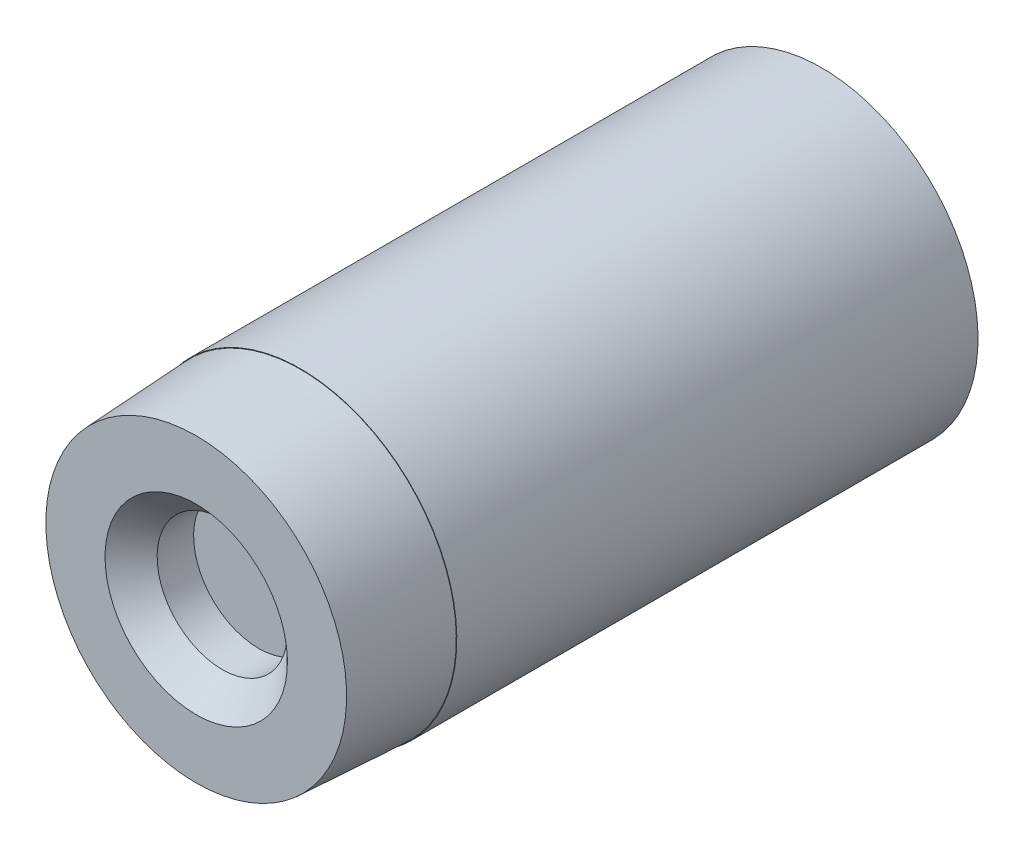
from build123d import *


with BuildPart() as part:
    # Sketch1 → Revolve1 (revolve)
    with BuildSketch(Plane(origin=(0, 0, 0), x_dir=(0, 0, -1), z_dir=(1, 0, 0)), mode=Mode.PRIVATE) as revolve1_sk:
        Polygon((-10.8, 0), (0, 0), (0, 3), (-10, 3), (-10, 2.99), (-12, 2.885184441), (-12, 1.75), (-11.5, 1.25), (-10.8, 1.25), align=None)
    revolve(revolve1_sk.sketch.rotate(Axis((0, 0, 12), (0, 0, -1)), 180), axis=Axis((0, 0, 12), (0, 0, -1)))


solid = part.part
